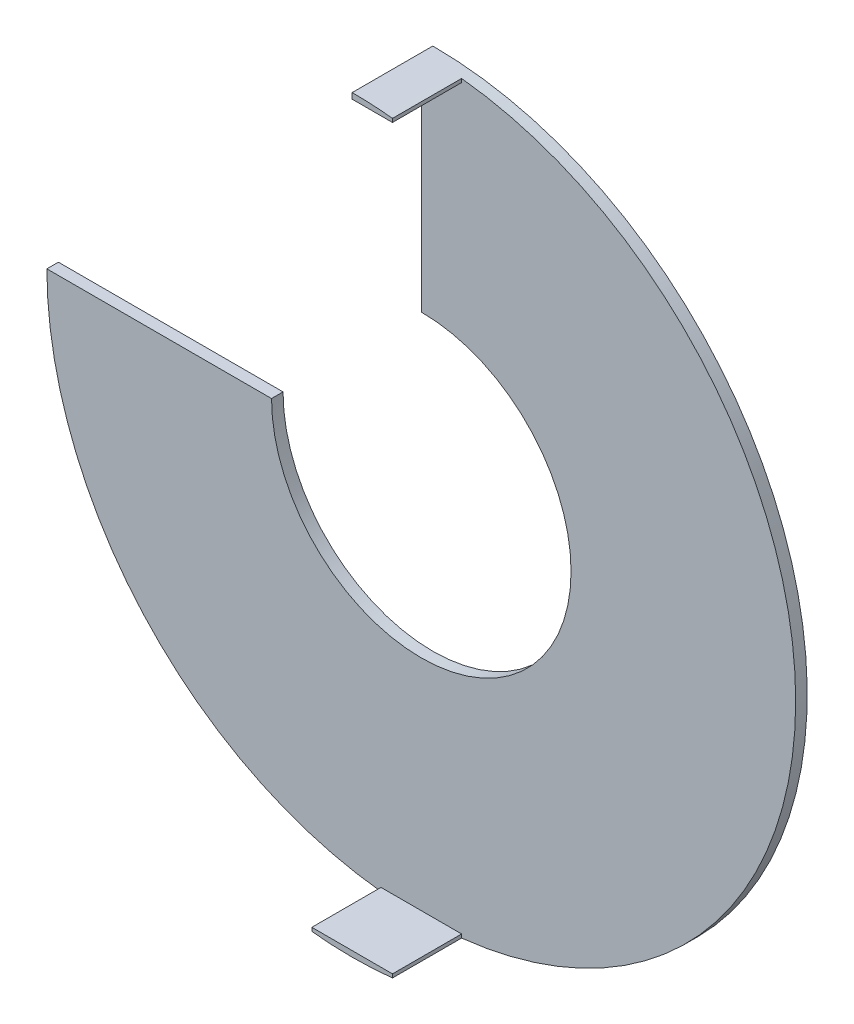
from build123d import *

# Parameters (mm, degrees)
ESQUISSE1_R                  = 16.25
ESQUISSE1_R_2                = 6.5
EXTRUSION1_DEPTH             = 0.5
EXTRUSION2_DEPTH             = 3
R_P_TITION_CIRCULAIRE1_COUNT = 2
ESQUISSE3_W                  = 21.923045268
ESQUISSE3_H                  = 17.125538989
ENL_V_MAT_EXTRU_1_DEPTH      = 24.245967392


with BuildPart() as part:
    # Esquisse1 → Extrusion1 (new body)
    with BuildSketch(Plane.XY):
        Circle(ESQUISSE1_R)
        Circle(ESQUISSE1_R_2, mode=Mode.SUBTRACT)
    extrude(amount=EXTRUSION1_DEPTH)

    # Esquisse2 → Extrusion2 (add)
    with BuildSketch(Plane.XY.offset(0.5)):
        with BuildLine():
            Line((-1.75, 16.155494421), (-1.75, 16))
            Line((-1.75, 16), (1.75, 16))
            Line((1.75, 16), (1.75, 16.155494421))
            ThreePointArc((1.75, 16.155494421), (0, 16.25), (-1.75, 16.155494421))
        make_face()
    extrusion2 = extrude(amount=EXTRUSION2_DEPTH)

    # R_p_tition circulaire1: Extrusion2 ×2 about axis
    r_p_tition_circulaire1_axis = Axis((0, 0, 0), (0, 0, 1))
    for i in range(1, R_P_TITION_CIRCULAIRE1_COUNT):
        add(extrusion2.rotate(r_p_tition_circulaire1_axis, i * 360 / R_P_TITION_CIRCULAIRE1_COUNT))

    # Esquisse3 → Enl_v. mat.-Extru.1 (cut, through all)
    with BuildSketch(Plane(origin=(0, 0, 0), x_dir=(0, 0, -1), z_dir=(1, 0, 0))):
        with Locations((-0.765444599, 8.562769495)):
            Rectangle(ESQUISSE3_W, ESQUISSE3_H)
    extrude(amount=-ENL_V_MAT_EXTRU_1_DEPTH, mode=Mode.SUBTRACT)


solid = part.part
